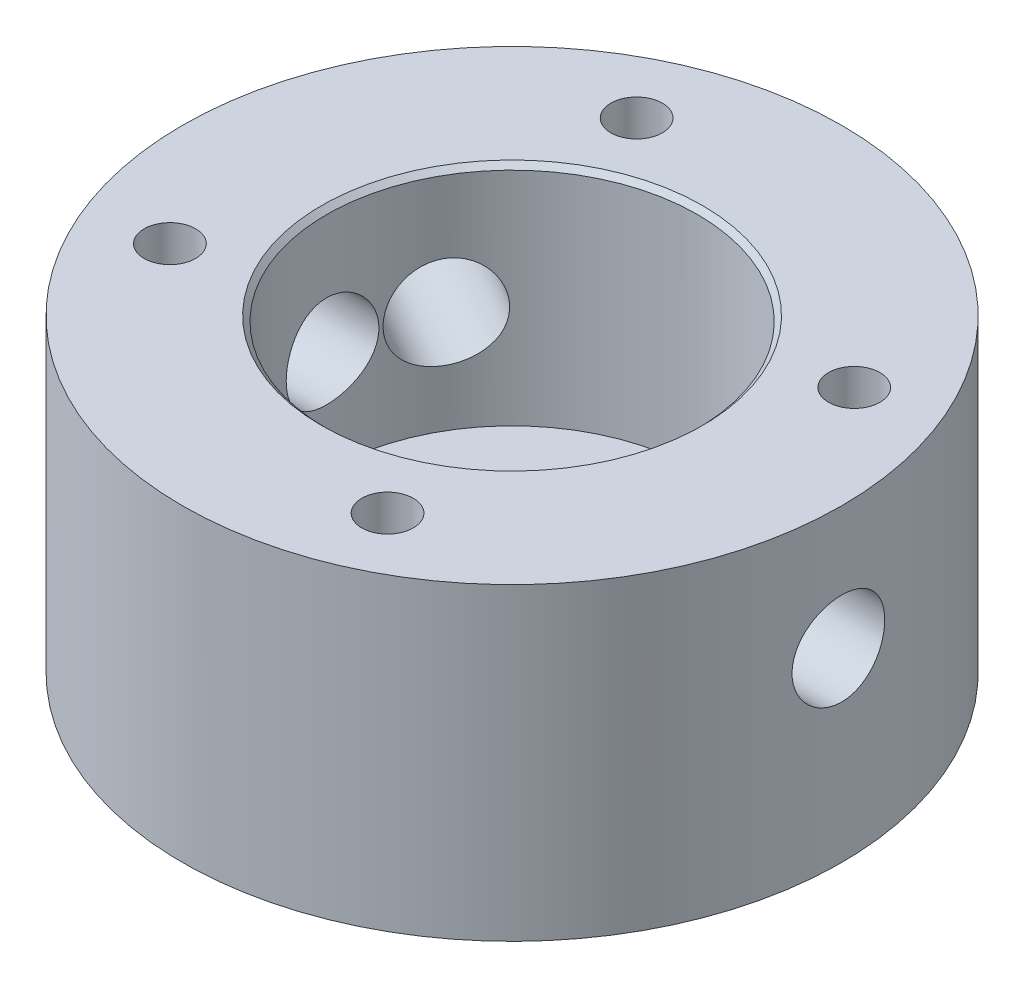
ISO-10303-21;
HEADER;
FILE_DESCRIPTION(('STEP AP214'),'2;1');
FILE_NAME('part.step','',(''),(''),'','','');
FILE_SCHEMA(('AUTOMOTIVE_DESIGN { 1 0 10303 214 1 1 1 1 }'));
ENDSEC;
DATA;
#1=APPLICATION_CONTEXT('core data for automotive mechanical design processes');
#2=APPLICATION_PROTOCOL_DEFINITION('international standard','automotive_design',2000,#1);
#3=PRODUCT_CONTEXT('',#1,'mechanical');
#4=PRODUCT('Part','Part','',(#3));
#5=PRODUCT_RELATED_PRODUCT_CATEGORY('part','',(#4));
#6=PRODUCT_DEFINITION_FORMATION('','',#4);
#7=PRODUCT_DEFINITION_CONTEXT('part definition',#1,'design');
#8=PRODUCT_DEFINITION('design','',#6,#7);
#9=PRODUCT_DEFINITION_SHAPE('','',#8);
#10=(LENGTH_UNIT() NAMED_UNIT(*) SI_UNIT(.MILLI.,.METRE.));
#11=(NAMED_UNIT(*) PLANE_ANGLE_UNIT() SI_UNIT($,.RADIAN.));
#12=(NAMED_UNIT(*) SI_UNIT($,.STERADIAN.) SOLID_ANGLE_UNIT());
#13=UNCERTAINTY_MEASURE_WITH_UNIT(LENGTH_MEASURE(1.E-05),#10,'distance_accuracy_value','');
#14=(GEOMETRIC_REPRESENTATION_CONTEXT(3) GLOBAL_UNCERTAINTY_ASSIGNED_CONTEXT((#13)) GLOBAL_UNIT_ASSIGNED_CONTEXT((#10,
#11,#12)) REPRESENTATION_CONTEXT('',''));
#15=CARTESIAN_POINT('',(0.,0.,0.));
#16=DIRECTION('',(0.,0.,1.));
#17=DIRECTION('',(1.,0.,0.));
#18=AXIS2_PLACEMENT_3D('',#15,#16,#17);
#19=CARTESIAN_POINT('',(0.,-9.,0.));
#20=DIRECTION('',(0.,-1.,0.));
#21=DIRECTION('',(0.,0.,-1.));
#22=AXIS2_PLACEMENT_3D('',#19,#20,#21);
#23=CYLINDRICAL_SURFACE('',#22,9.);
#24=CARTESIAN_POINT('',(-8.71421252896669,0.,2.24999999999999));
#25=CARTESIAN_POINT('',(-8.71421490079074,-0.124245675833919,2.24999647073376));
#26=CARTESIAN_POINT('',(-8.71689875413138,-0.248530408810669,2.23967362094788));
#27=CARTESIAN_POINT('',(-8.72731675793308,-0.493530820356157,2.19872081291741));
#28=CARTESIAN_POINT('',(-8.73505384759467,-0.614244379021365,2.16807903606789));
#29=CARTESIAN_POINT('',(-8.75464852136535,-0.848523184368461,2.08754207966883));
#30=CARTESIAN_POINT('',(-8.76650078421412,-0.962097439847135,2.03767175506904));
#31=CARTESIAN_POINT('',(-8.79298372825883,-1.17927976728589,1.92016902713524));
#32=CARTESIAN_POINT('',(-8.8076145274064,-1.28288741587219,1.85253586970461));
#33=CARTESIAN_POINT('',(-8.83836644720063,-1.47947548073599,1.69983758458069));
#34=CARTESIAN_POINT('',(-8.85451137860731,-1.57220424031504,1.61445319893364));
#35=CARTESIAN_POINT('',(-8.88626587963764,-1.7421852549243,1.42936385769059));
#36=CARTESIAN_POINT('',(-8.9018753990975,-1.81943606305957,1.32965756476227));
#37=CARTESIAN_POINT('',(-8.93106373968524,-1.95729792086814,1.11703068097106));
#38=CARTESIAN_POINT('',(-8.94461118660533,-2.01766174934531,1.0039451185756));
#39=CARTESIAN_POINT('',(-8.96787730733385,-2.11842867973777,0.768836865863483));
#40=CARTESIAN_POINT('',(-8.9775965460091,-2.15883472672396,0.646815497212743));
#41=CARTESIAN_POINT('',(-8.99194282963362,-2.21773305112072,0.399922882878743));
#42=CARTESIAN_POINT('',(-8.99666904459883,-2.23665267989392,0.275159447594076));
#43=CARTESIAN_POINT('',(-9.00084234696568,-2.25338254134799,0.0241459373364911));
#44=CARTESIAN_POINT('',(-9.00029021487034,-2.25119589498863,-0.102103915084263));
#45=CARTESIAN_POINT('',(-8.9940428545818,-2.22608263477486,-0.349542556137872));
#46=CARTESIAN_POINT('',(-8.98846202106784,-2.20361730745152,-0.470781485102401));
#47=CARTESIAN_POINT('',(-8.97291752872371,-2.13932585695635,-0.707711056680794));
#48=CARTESIAN_POINT('',(-8.96295363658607,-2.09749870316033,-0.823401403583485));
#49=CARTESIAN_POINT('',(-8.93958758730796,-1.99529768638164,-1.04716508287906));
#50=CARTESIAN_POINT('',(-8.9261551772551,-1.93475965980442,-1.15516014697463));
#51=CARTESIAN_POINT('',(-8.89730913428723,-1.79697988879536,-1.3596201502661));
#52=CARTESIAN_POINT('',(-8.88189515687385,-1.71973523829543,-1.45608307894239));
#53=CARTESIAN_POINT('',(-8.85027342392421,-1.54826213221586,-1.63749157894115));
#54=CARTESIAN_POINT('',(-8.83405547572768,-1.45363059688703,-1.72205477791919));
#55=CARTESIAN_POINT('',(-8.80303539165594,-1.25136002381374,-1.87419684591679));
#56=CARTESIAN_POINT('',(-8.7882333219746,-1.143720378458,-1.94177492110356));
#57=CARTESIAN_POINT('',(-8.76168447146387,-0.917738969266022,-2.05827329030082));
#58=CARTESIAN_POINT('',(-8.74995285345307,-0.799347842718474,-2.10710152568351));
#59=CARTESIAN_POINT('',(-8.73106776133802,-0.555673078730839,-2.18404264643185));
#60=CARTESIAN_POINT('',(-8.72391330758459,-0.430390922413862,-2.21215996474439));
#61=CARTESIAN_POINT('',(-8.71519820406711,-0.180036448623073,-2.24624667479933));
#62=CARTESIAN_POINT('',(-8.7134948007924,-0.0550459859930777,-2.2527814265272));
#63=CARTESIAN_POINT('',(-8.71548609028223,0.194239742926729,-2.24506529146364));
#64=CARTESIAN_POINT('',(-8.71918028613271,0.318535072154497,-2.23081631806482));
#65=CARTESIAN_POINT('',(-8.73141373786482,0.560802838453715,-2.18243291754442));
#66=CARTESIAN_POINT('',(-8.73987273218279,0.678845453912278,-2.14862766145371));
#67=CARTESIAN_POINT('',(-8.76060646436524,0.907588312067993,-2.06245627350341));
#68=CARTESIAN_POINT('',(-8.77288165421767,1.0182876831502,-2.01008794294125));
#69=CARTESIAN_POINT('',(-8.8001652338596,1.2315971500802,-1.88709360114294));
#70=CARTESIAN_POINT('',(-8.81522251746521,1.33400595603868,-1.81612957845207));
#71=CARTESIAN_POINT('',(-8.84625374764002,1.52566952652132,-1.65838565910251));
#72=CARTESIAN_POINT('',(-8.86222784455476,1.61492212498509,-1.57160316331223));
#73=CARTESIAN_POINT('',(-8.89377662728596,1.78002993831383,-1.38209112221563));
#74=CARTESIAN_POINT('',(-8.90933131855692,1.85549405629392,-1.27901689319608));
#75=CARTESIAN_POINT('',(-8.93787494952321,1.98804228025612,-1.06133103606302));
#76=CARTESIAN_POINT('',(-8.95086402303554,2.04512734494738,-0.946720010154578));
#77=CARTESIAN_POINT('',(-8.97273104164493,2.13880143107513,-0.710005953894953));
#78=CARTESIAN_POINT('',(-8.98163847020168,2.17553785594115,-0.587964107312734));
#79=CARTESIAN_POINT('',(-8.9944676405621,2.22791430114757,-0.339186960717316));
#80=CARTESIAN_POINT('',(-8.99839034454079,2.24355839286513,-0.212452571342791));
#81=CARTESIAN_POINT('',(-9.00076881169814,2.25307707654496,0.0384379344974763));
#82=CARTESIAN_POINT('',(-8.99936952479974,2.24752884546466,0.162571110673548));
#83=CARTESIAN_POINT('',(-8.99158267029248,2.21614238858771,0.408076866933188));
#84=CARTESIAN_POINT('',(-8.9851952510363,2.19030476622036,0.529449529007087));
#85=CARTESIAN_POINT('',(-8.9681722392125,2.11938250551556,0.765384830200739));
#86=CARTESIAN_POINT('',(-8.95755970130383,2.07440223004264,0.879980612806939));
#87=CARTESIAN_POINT('',(-8.93320400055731,1.96656619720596,1.10006336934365));
#88=CARTESIAN_POINT('',(-8.91946044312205,1.9037081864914,1.20554919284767));
#89=CARTESIAN_POINT('',(-8.88991311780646,1.7601407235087,1.40715433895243));
#90=CARTESIAN_POINT('',(-8.87406788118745,1.67903967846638,1.50298872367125));
#91=CARTESIAN_POINT('',(-8.84228960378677,1.50204858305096,1.67988379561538));
#92=CARTESIAN_POINT('',(-8.8263565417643,1.40615478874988,1.76094073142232));
#93=CARTESIAN_POINT('',(-8.7958682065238,1.20014681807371,1.90746455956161));
#94=CARTESIAN_POINT('',(-8.781344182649,1.08980072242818,1.97261239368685));
#95=CARTESIAN_POINT('',(-8.75573899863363,0.859375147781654,2.0833355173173));
#96=CARTESIAN_POINT('',(-8.74465533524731,0.739302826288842,2.12892504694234));
#97=CARTESIAN_POINT('',(-8.72891794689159,0.516201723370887,2.19245068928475));
#98=CARTESIAN_POINT('',(-8.72344491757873,0.414240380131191,2.21398463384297));
#99=CARTESIAN_POINT('',(-8.71609136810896,0.208195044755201,2.24276015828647));
#100=CARTESIAN_POINT('',(-8.71421054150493,0.104111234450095,2.25000295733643));
#101=CARTESIAN_POINT('',(-8.71421252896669,0.,2.24999999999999));
#102=B_SPLINE_CURVE_WITH_KNOTS('',3,(#24,#25,#26,#27,#28,#29,#30,#31,#32,#33,#34,#35,#36,#37,
#38,#39,#40,#41,#42,#43,#44,#45,#46,#47,#48,#49,#50,#51,#52,#53,#54,#55,#56,#57,#58,#59,#60,#61,
#62,#63,#64,#65,#66,#67,#68,#69,#70,#71,#72,#73,#74,#75,#76,#77,#78,#79,#80,#81,#82,#83,#84,#85,
#86,#87,#88,#89,#90,#91,#92,#93,#94,#95,#96,#97,#98,#99,#100,#101),.UNSPECIFIED.,.T.,.F.,(4,2,2,
2,2,2,2,2,2,2,2,2,2,2,2,2,2,2,2,2,2,2,2,2,2,2,2,2,2,2,2,2,2,2,2,2,2,2,4),(0.,0.372354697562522,
0.744926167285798,1.11701765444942,1.4891249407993,1.86861558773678,2.24814169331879,
2.63296346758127,3.01772843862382,3.39469875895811,3.77161333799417,4.14016436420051,
4.50873501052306,4.88063586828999,5.25260146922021,5.63463419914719,6.0166847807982,
6.40058788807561,6.78440880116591,7.15809217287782,7.5317411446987,7.89927664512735,
8.26685569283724,8.6416456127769,9.01649717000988,9.40072797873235,9.78493874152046,
10.1663286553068,10.5476449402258,10.9186510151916,11.2896460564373,11.6586438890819,
12.0276882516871,12.4055738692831,12.7835552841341,13.1685882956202,13.5533404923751,
13.8653804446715,14.1773937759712),.UNSPECIFIED.);
#103=CARTESIAN_POINT('',(-8.71421252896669,0.,2.24999999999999));
#104=VERTEX_POINT('',#103);
#105=EDGE_CURVE('E79',#104,#104,#102,.T.);
#106=ORIENTED_EDGE('',*,*,#105,.F.);
#107=EDGE_LOOP('',(#106));
#108=FACE_BOUND('',#107,.T.);
#109=CARTESIAN_POINT('',(0.,5.74999999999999,0.));
#110=DIRECTION('',(0.,1.,0.));
#111=DIRECTION('',(0.,0.,1.));
#112=AXIS2_PLACEMENT_3D('',#109,#110,#111);
#113=CIRCLE('',#112,9.);
#114=CARTESIAN_POINT('',(0.,5.74999999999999,9.));
#115=VERTEX_POINT('',#114);
#116=EDGE_CURVE('E176',#115,#115,#113,.T.);
#117=ORIENTED_EDGE('',*,*,#116,.T.);
#118=EDGE_LOOP('',(#117));
#119=FACE_BOUND('',#118,.T.);
#120=CARTESIAN_POINT('',(-8.67172942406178,0.,-2.4085491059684));
#121=CARTESIAN_POINT('',(-8.67172971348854,-0.124245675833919,-2.40855334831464));
#122=CARTESIAN_POINT('',(-8.66889257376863,-0.248530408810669,-2.41883512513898));
#123=CARTESIAN_POINT('',(-8.65743842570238,-0.493530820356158,-2.45951029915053));
#124=CARTESIAN_POINT('',(-8.64881805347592,-0.614244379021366,-2.4899154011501));
#125=CARTESIAN_POINT('',(-8.62551906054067,-0.848523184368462,-2.56945978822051));
#126=CARTESIAN_POINT('',(-8.61084825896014,-0.962097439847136,-2.61857488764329));
#127=CARTESIAN_POINT('',(-8.57503179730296,-1.17927976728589,-2.73357670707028));
#128=CARTESIAN_POINT('',(-8.55388586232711,-1.28288741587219,-2.79946413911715));
#129=CARTESIAN_POINT('',(-8.50416866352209,-1.47947548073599,-2.9470806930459));
#130=CARTESIAN_POINT('',(-8.47545839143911,-1.57220424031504,-3.02909820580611));
#131=CARTESIAN_POINT('',(-8.41041392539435,-1.7421852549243,-3.20526752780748));
#132=CARTESIAN_POINT('',(-8.37407901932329,-1.81943606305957,-3.29942047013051));
#133=CARTESIAN_POINT('',(-8.29304342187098,-1.95729792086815,-3.49815492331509));
#134=CARTESIAN_POINT('',(-8.24823307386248,-2.01766174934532,-3.60286361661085));
#135=CARTESIAN_POINT('',(-8.15082799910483,-2.11842867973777,-3.81810639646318));
#136=CARTESIAN_POINT('',(-8.09823442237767,-2.15883472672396,-3.92863962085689));
#137=CARTESIAN_POINT('',(-7.9872123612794,-2.21773305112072,-4.14962803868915));
#138=CARTESIAN_POINT('',(-7.92892366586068,-2.23665267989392,-4.26003945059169));
#139=CARTESIAN_POINT('',(-7.80703109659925,-2.253382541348,-4.47951017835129));
#140=CARTESIAN_POINT('',(-7.74342800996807,-2.25119589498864,-4.58856969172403));
#141=CARTESIAN_POINT('',(-7.61429831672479,-2.22608263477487,-4.79973416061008));
#142=CARTESIAN_POINT('',(-7.54884570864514,-2.20361730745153,-4.901939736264));
#143=CARTESIAN_POINT('',(-7.416918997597,-2.13932585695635,-5.09935451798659));
#144=CARTESIAN_POINT('',(-7.35044484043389,-2.09749870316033,-5.19456335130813));
#145=CARTESIAN_POINT('',(-7.21832740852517,-1.99529768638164,-5.37666535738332));
#146=CARTESIAN_POINT('',(-7.15269706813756,-1.93475965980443,-5.46347562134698));
#147=CARTESIAN_POINT('',(-7.02548566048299,-1.79697988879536,-5.6261201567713));
#148=CARTESIAN_POINT('',(-6.96390530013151,-1.71973523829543,-5.70195251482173));
#149=CARTESIAN_POINT('',(-6.84581582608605,-1.54826213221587,-5.84324601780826));
#150=CARTESIAN_POINT('',(-6.78948907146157,-1.45363059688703,-5.90837092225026));
#151=CARTESIAN_POINT('',(-6.68655385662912,-1.25136002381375,-6.02461977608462));
#152=CARTESIAN_POINT('',(-6.6399458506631,-1.143720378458,-6.07574307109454));
#153=CARTESIAN_POINT('',(-6.55870468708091,-0.917738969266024,-6.16335919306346));
#154=CARTESIAN_POINT('',(-6.52413069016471,-0.799347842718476,-6.19977987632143));
#155=CARTESIAN_POINT('',(-6.4693051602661,-0.555673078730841,-6.25697029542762));
#156=CARTESIAN_POINT('',(-6.44905056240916,-0.430390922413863,-6.27774338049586));
#157=CARTESIAN_POINT('',(-6.42445970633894,-0.180036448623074,-6.30290578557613));
#158=CARTESIAN_POINT('',(-6.41971713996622,-0.0550459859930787,-6.30771334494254));
#159=CARTESIAN_POINT('',(-6.42529971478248,0.194239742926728,-6.30202662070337));
#160=CARTESIAN_POINT('',(-6.43562346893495,0.318535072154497,-6.29153374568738));
#161=CARTESIAN_POINT('',(-6.47040964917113,0.560802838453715,-6.2557492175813));
#162=CARTESIAN_POINT('',(-6.49463798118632,0.678845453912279,-6.23070250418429));
#163=CARTESIAN_POINT('',(-6.55567961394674,0.907588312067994,-6.16644275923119));
#164=CARTESIAN_POINT('',(-6.5924944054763,1.01828768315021,-6.12722804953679));
#165=CARTESIAN_POINT('',(-6.67761984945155,1.2315971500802,-6.03435361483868));
#166=CARTESIAN_POINT('',(-6.72614185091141,1.33400595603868,-5.98042561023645));
#167=CARTESIAN_POINT('',(-6.83188764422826,1.52566952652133,-5.85933098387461));
#168=CARTESIAN_POINT('',(-6.88911286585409,1.61492212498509,-5.79216218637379));
#169=CARTESIAN_POINT('',(-7.01119093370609,1.78002993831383,-5.6438143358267));
#170=CARTESIAN_POINT('',(-7.07619880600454,1.85549405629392,-5.56232678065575));
#171=CARTESIAN_POINT('',(-7.20976124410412,1.98804228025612,-5.38807711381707));
#172=CARTESIAN_POINT('',(-7.27831562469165,2.04512734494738,-5.29531559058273));
#173=CARTESIAN_POINT('',(-7.41561004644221,2.13880143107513,-5.10124871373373));
#174=CARTESIAN_POINT('',(-7.48434502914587,2.17553785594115,-5.00001108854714));
#175=CARTESIAN_POINT('',(-7.61984398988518,2.22791430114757,-4.79097834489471));
#176=CARTESIAN_POINT('',(-7.68660834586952,2.24355839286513,-4.68318449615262));
#177=CARTESIAN_POINT('',(-7.81411341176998,2.25307707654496,-4.46709617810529));
#178=CARTESIAN_POINT('',(-7.87496818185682,2.24752884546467,-4.35889405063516));
#179=CARTESIAN_POINT('',(-7.99097744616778,2.21614238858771,-4.14238640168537));
#180=CARTESIAN_POINT('',(-8.04613210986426,2.19030476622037,-4.03408088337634));
#181=CARTESIAN_POINT('',(-8.14935739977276,2.11938250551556,-3.82124341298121));
#182=CARTESIAN_POINT('',(-8.19746456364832,2.07440223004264,-3.71669428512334));
#183=CARTESIAN_POINT('',(-8.28641328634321,1.96656619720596,-3.51391917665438));
#184=CARTESIAN_POINT('',(-8.32725392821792,1.90370818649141,-3.41569399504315));
#185=CARTESIAN_POINT('',(-8.40246776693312,1.7601407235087,-3.22632515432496));
#186=CARTESIAN_POINT('',(-8.4366625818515,1.67903967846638,-3.13540752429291));
#187=CARTESIAN_POINT('',(-8.49758932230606,1.50204858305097,-2.96632275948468));
#188=CARTESIAN_POINT('',(-8.524319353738,1.40615478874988,-2.88815886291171));
#189=CARTESIAN_POINT('',(-8.57117759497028,1.20014681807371,-2.74602133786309));
#190=CARTESIAN_POINT('',(-8.59117333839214,1.08980072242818,-2.6823396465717));
#191=CARTESIAN_POINT('',(-8.62436016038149,0.859375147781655,-2.57364801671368));
#192=CARTESIAN_POINT('',(-8.63755619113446,0.739302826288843,-2.52862449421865));
#193=CARTESIAN_POINT('',(-8.65569003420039,0.516201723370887,-2.46574097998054));
#194=CARTESIAN_POINT('',(-8.6617172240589,0.414240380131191,-2.444355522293));
#195=CARTESIAN_POINT('',(-8.66973662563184,0.208195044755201,-2.41575841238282));
#196=CARTESIAN_POINT('',(-8.67172918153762,0.104111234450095,-2.40854555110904));
#197=CARTESIAN_POINT('',(-8.67172942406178,0.,-2.4085491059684));
#198=B_SPLINE_CURVE_WITH_KNOTS('',3,(#120,#121,#122,#123,#124,#125,#126,#127,#128,#129,#130,
#131,#132,#133,#134,#135,#136,#137,#138,#139,#140,#141,#142,#143,#144,#145,#146,#147,#148,#149,
#150,#151,#152,#153,#154,#155,#156,#157,#158,#159,#160,#161,#162,#163,#164,#165,#166,#167,#168,
#169,#170,#171,#172,#173,#174,#175,#176,#177,#178,#179,#180,#181,#182,#183,#184,#185,#186,#187,
#188,#189,#190,#191,#192,#193,#194,#195,#196,#197),.UNSPECIFIED.,.T.,.F.,(4,2,2,2,2,2,2,2,2,2,2,
2,2,2,2,2,2,2,2,2,2,2,2,2,2,2,2,2,2,2,2,2,2,2,2,2,2,2,4),(0.,0.372354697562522,
0.744926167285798,1.11701765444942,1.4891249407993,1.86861558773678,2.2481416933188,
2.63296346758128,3.01772843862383,3.39469875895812,3.77161333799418,4.14016436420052,
4.50873501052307,4.88063586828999,5.25260146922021,5.6346341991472,6.01668478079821,
6.40058788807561,6.78440880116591,7.15809217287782,7.53174114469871,7.89927664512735,
8.26685569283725,8.64164561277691,9.01649717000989,9.40072797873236,9.78493874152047,
10.1663286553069,10.5476449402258,10.9186510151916,11.2896460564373,11.6586438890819,
12.0276882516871,12.4055738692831,12.7835552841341,13.1685882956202,13.5533404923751,
13.8653804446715,14.1773937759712),.UNSPECIFIED.);
#199=CARTESIAN_POINT('',(-8.67172942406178,0.,-2.4085491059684));
#200=VERTEX_POINT('',#199);
#201=EDGE_CURVE('E100',#200,#200,#198,.T.);
#202=ORIENTED_EDGE('',*,*,#201,.F.);
#203=EDGE_LOOP('',(#202));
#204=FACE_BOUND('',#203,.T.);
#205=CARTESIAN_POINT('',(8.71421252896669,0.,-2.25));
#206=CARTESIAN_POINT('',(8.71421490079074,-0.124245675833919,-2.24999647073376));
#207=CARTESIAN_POINT('',(8.71689875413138,-0.248530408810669,-2.23967362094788));
#208=CARTESIAN_POINT('',(8.72731675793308,-0.493530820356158,-2.19872081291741));
#209=CARTESIAN_POINT('',(8.73505384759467,-0.614244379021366,-2.16807903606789));
#210=CARTESIAN_POINT('',(8.75464852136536,-0.848523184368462,-2.08754207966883));
#211=CARTESIAN_POINT('',(8.76650078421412,-0.962097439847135,-2.03767175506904));
#212=CARTESIAN_POINT('',(8.79298372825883,-1.17927976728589,-1.92016902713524));
#213=CARTESIAN_POINT('',(8.8076145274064,-1.28288741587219,-1.85253586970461));
#214=CARTESIAN_POINT('',(8.83836644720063,-1.47947548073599,-1.69983758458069));
#215=CARTESIAN_POINT('',(8.85451137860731,-1.57220424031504,-1.61445319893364));
#216=CARTESIAN_POINT('',(8.88626587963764,-1.7421852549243,-1.42936385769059));
#217=CARTESIAN_POINT('',(8.9018753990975,-1.81943606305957,-1.32965756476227));
#218=CARTESIAN_POINT('',(8.93106373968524,-1.95729792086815,-1.11703068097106));
#219=CARTESIAN_POINT('',(8.94461118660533,-2.01766174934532,-1.00394511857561));
#220=CARTESIAN_POINT('',(8.96787730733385,-2.11842867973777,-0.768836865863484));
#221=CARTESIAN_POINT('',(8.9775965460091,-2.15883472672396,-0.646815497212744));
#222=CARTESIAN_POINT('',(8.99194282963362,-2.21773305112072,-0.399922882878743));
#223=CARTESIAN_POINT('',(8.99666904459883,-2.23665267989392,-0.275159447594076));
#224=CARTESIAN_POINT('',(9.00084234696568,-2.25338254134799,-0.0241459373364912));
#225=CARTESIAN_POINT('',(9.00029021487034,-2.25119589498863,0.102103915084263));
#226=CARTESIAN_POINT('',(8.9940428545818,-2.22608263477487,0.349542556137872));
#227=CARTESIAN_POINT('',(8.98846202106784,-2.20361730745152,0.470781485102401));
#228=CARTESIAN_POINT('',(8.97291752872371,-2.13932585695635,0.707711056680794));
#229=CARTESIAN_POINT('',(8.96295363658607,-2.09749870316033,0.823401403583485));
#230=CARTESIAN_POINT('',(8.93958758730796,-1.99529768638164,1.04716508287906));
#231=CARTESIAN_POINT('',(8.9261551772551,-1.93475965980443,1.15516014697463));
#232=CARTESIAN_POINT('',(8.89730913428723,-1.79697988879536,1.3596201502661));
#233=CARTESIAN_POINT('',(8.88189515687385,-1.71973523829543,1.45608307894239));
#234=CARTESIAN_POINT('',(8.85027342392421,-1.54826213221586,1.63749157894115));
#235=CARTESIAN_POINT('',(8.83405547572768,-1.45363059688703,1.72205477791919));
#236=CARTESIAN_POINT('',(8.80303539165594,-1.25136002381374,1.8741968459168));
#237=CARTESIAN_POINT('',(8.7882333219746,-1.143720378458,1.94177492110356));
#238=CARTESIAN_POINT('',(8.76168447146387,-0.917738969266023,2.05827329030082));
#239=CARTESIAN_POINT('',(8.74995285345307,-0.799347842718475,2.10710152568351));
#240=CARTESIAN_POINT('',(8.73106776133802,-0.55567307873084,2.18404264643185));
#241=CARTESIAN_POINT('',(8.72391330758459,-0.430390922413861,2.21215996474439));
#242=CARTESIAN_POINT('',(8.71519820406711,-0.180036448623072,2.24624667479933));
#243=CARTESIAN_POINT('',(8.7134948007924,-0.0550459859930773,2.2527814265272));
#244=CARTESIAN_POINT('',(8.71548609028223,0.194239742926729,2.24506529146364));
#245=CARTESIAN_POINT('',(8.71918028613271,0.318535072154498,2.23081631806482));
#246=CARTESIAN_POINT('',(8.73141373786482,0.560802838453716,2.18243291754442));
#247=CARTESIAN_POINT('',(8.73987273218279,0.678845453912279,2.14862766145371));
#248=CARTESIAN_POINT('',(8.76060646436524,0.907588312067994,2.06245627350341));
#249=CARTESIAN_POINT('',(8.77288165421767,1.0182876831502,2.01008794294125));
#250=CARTESIAN_POINT('',(8.8001652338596,1.2315971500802,1.88709360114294));
#251=CARTESIAN_POINT('',(8.81522251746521,1.33400595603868,1.81612957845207));
#252=CARTESIAN_POINT('',(8.84625374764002,1.52566952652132,1.65838565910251));
#253=CARTESIAN_POINT('',(8.86222784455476,1.61492212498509,1.57160316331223));
#254=CARTESIAN_POINT('',(8.89377662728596,1.78002993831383,1.38209112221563));
#255=CARTESIAN_POINT('',(8.90933131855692,1.85549405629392,1.27901689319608));
#256=CARTESIAN_POINT('',(8.93787494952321,1.98804228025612,1.06133103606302));
#257=CARTESIAN_POINT('',(8.95086402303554,2.04512734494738,0.946720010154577));
#258=CARTESIAN_POINT('',(8.97273104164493,2.13880143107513,0.710005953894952));
#259=CARTESIAN_POINT('',(8.98163847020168,2.17553785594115,0.587964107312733));
#260=CARTESIAN_POINT('',(8.9944676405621,2.22791430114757,0.339186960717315));
#261=CARTESIAN_POINT('',(8.99839034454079,2.24355839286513,0.21245257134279));
#262=CARTESIAN_POINT('',(9.00076881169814,2.25307707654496,-0.0384379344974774));
#263=CARTESIAN_POINT('',(8.99936952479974,2.24752884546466,-0.162571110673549));
#264=CARTESIAN_POINT('',(8.99158267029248,2.21614238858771,-0.408076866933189));
#265=CARTESIAN_POINT('',(8.9851952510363,2.19030476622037,-0.529449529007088));
#266=CARTESIAN_POINT('',(8.9681722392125,2.11938250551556,-0.76538483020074));
#267=CARTESIAN_POINT('',(8.95755970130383,2.07440223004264,-0.87998061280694));
#268=CARTESIAN_POINT('',(8.9332040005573,1.96656619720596,-1.10006336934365));
#269=CARTESIAN_POINT('',(8.91946044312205,1.90370818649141,-1.20554919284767));
#270=CARTESIAN_POINT('',(8.88991311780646,1.7601407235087,-1.40715433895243));
#271=CARTESIAN_POINT('',(8.87406788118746,1.67903967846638,-1.50298872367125));
#272=CARTESIAN_POINT('',(8.84228960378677,1.50204858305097,-1.67988379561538));
#273=CARTESIAN_POINT('',(8.8263565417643,1.40615478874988,-1.76094073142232));
#274=CARTESIAN_POINT('',(8.7958682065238,1.20014681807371,-1.90746455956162));
#275=CARTESIAN_POINT('',(8.781344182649,1.08980072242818,-1.97261239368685));
#276=CARTESIAN_POINT('',(8.75573899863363,0.859375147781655,-2.0833355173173));
#277=CARTESIAN_POINT('',(8.74465533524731,0.739302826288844,-2.12892504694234));
#278=CARTESIAN_POINT('',(8.72891794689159,0.516201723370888,-2.19245068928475));
#279=CARTESIAN_POINT('',(8.72344491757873,0.414240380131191,-2.21398463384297));
#280=CARTESIAN_POINT('',(8.71609136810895,0.208195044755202,-2.24276015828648));
#281=CARTESIAN_POINT('',(8.71421054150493,0.104111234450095,-2.25000295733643));
#282=CARTESIAN_POINT('',(8.71421252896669,0.,-2.25));
#283=B_SPLINE_CURVE_WITH_KNOTS('',3,(#205,#206,#207,#208,#209,#210,#211,#212,#213,#214,#215,
#216,#217,#218,#219,#220,#221,#222,#223,#224,#225,#226,#227,#228,#229,#230,#231,#232,#233,#234,
#235,#236,#237,#238,#239,#240,#241,#242,#243,#244,#245,#246,#247,#248,#249,#250,#251,#252,#253,
#254,#255,#256,#257,#258,#259,#260,#261,#262,#263,#264,#265,#266,#267,#268,#269,#270,#271,#272,
#273,#274,#275,#276,#277,#278,#279,#280,#281,#282),.UNSPECIFIED.,.T.,.F.,(4,2,2,2,2,2,2,2,2,2,2,
2,2,2,2,2,2,2,2,2,2,2,2,2,2,2,2,2,2,2,2,2,2,2,2,2,2,2,4),(0.,0.372354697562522,
0.744926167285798,1.11701765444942,1.4891249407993,1.86861558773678,2.24814169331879,
2.63296346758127,3.01772843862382,3.39469875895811,3.77161333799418,4.14016436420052,
4.50873501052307,4.88063586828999,5.25260146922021,5.63463419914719,6.01668478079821,
6.40058788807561,6.78440880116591,7.15809217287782,7.53174114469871,7.89927664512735,
8.26685569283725,8.6416456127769,9.01649717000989,9.40072797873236,9.78493874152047,
10.1663286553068,10.5476449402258,10.9186510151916,11.2896460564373,11.6586438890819,
12.0276882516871,12.4055738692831,12.7835552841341,13.1685882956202,13.5533404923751,
13.8653804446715,14.1773937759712),.UNSPECIFIED.);
#284=CARTESIAN_POINT('',(8.71421252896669,0.,-2.25));
#285=VERTEX_POINT('',#284);
#286=EDGE_CURVE('E107',#285,#285,#283,.T.);
#287=ORIENTED_EDGE('',*,*,#286,.F.);
#288=EDGE_LOOP('',(#287));
#289=FACE_BOUND('',#288,.T.);
#290=CARTESIAN_POINT('',(0.,-5.,0.));
#291=DIRECTION('',(0.,-1.,0.));
#292=DIRECTION('',(0.,0.,-1.));
#293=AXIS2_PLACEMENT_3D('',#290,#291,#292);
#294=CIRCLE('',#293,9.);
#295=CARTESIAN_POINT('',(0.,-5.,-9.));
#296=VERTEX_POINT('',#295);
#297=EDGE_CURVE('E133',#296,#296,#294,.T.);
#298=ORIENTED_EDGE('',*,*,#297,.T.);
#299=EDGE_LOOP('',(#298));
#300=FACE_BOUND('',#299,.T.);
#301=ADVANCED_FACE('F37',(#108,#119,#204,#289,#300),#23,.F.);
#302=CARTESIAN_POINT('',(9.,-5.,0.));
#303=DIRECTION('',(0.,1.,0.));
#304=DIRECTION('',(0.,0.,1.));
#305=AXIS2_PLACEMENT_3D('',#302,#303,#304);
#306=PLANE('',#305);
#307=CARTESIAN_POINT('',(0.,-5.,0.));
#308=DIRECTION('',(0.,1.,0.));
#309=DIRECTION('',(0.,0.,1.));
#310=AXIS2_PLACEMENT_3D('',#307,#308,#309);
#311=CIRCLE('',#310,3.50000000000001);
#312=CARTESIAN_POINT('',(0.,-5.,3.50000000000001));
#313=VERTEX_POINT('',#312);
#314=EDGE_CURVE('E132',#313,#313,#311,.F.);
#315=ORIENTED_EDGE('',*,*,#314,.T.);
#316=EDGE_LOOP('',(#315));
#317=FACE_BOUND('',#316,.T.);
#318=ORIENTED_EDGE('',*,*,#297,.F.);
#319=EDGE_LOOP('',(#318));
#320=FACE_BOUND('',#319,.T.);
#321=ADVANCED_FACE('F161',(#317,#320),#306,.T.);
#322=CARTESIAN_POINT('',(0.,-9.,0.));
#323=DIRECTION('',(0.,-1.,0.));
#324=DIRECTION('',(0.,0.,-1.));
#325=AXIS2_PLACEMENT_3D('',#322,#323,#324);
#326=CYLINDRICAL_SURFACE('',#325,3.);
#327=CARTESIAN_POINT('',(0.,-5.50000000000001,0.));
#328=DIRECTION('',(0.,1.,0.));
#329=DIRECTION('',(0.,0.,1.));
#330=AXIS2_PLACEMENT_3D('',#327,#328,#329);
#331=CIRCLE('',#330,3.);
#332=CARTESIAN_POINT('',(0.,-5.50000000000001,3.));
#333=VERTEX_POINT('',#332);
#334=EDGE_CURVE('E174',#333,#333,#331,.T.);
#335=ORIENTED_EDGE('',*,*,#334,.T.);
#336=EDGE_LOOP('',(#335));
#337=FACE_BOUND('',#336,.T.);
#338=CARTESIAN_POINT('',(0.,-9.,0.));
#339=DIRECTION('',(0.,-1.,0.));
#340=DIRECTION('',(0.,0.,-1.));
#341=AXIS2_PLACEMENT_3D('',#338,#339,#340);
#342=CIRCLE('',#341,3.);
#343=CARTESIAN_POINT('',(0.,-9.,-3.));
#344=VERTEX_POINT('',#343);
#345=EDGE_CURVE('E153',#344,#344,#342,.T.);
#346=ORIENTED_EDGE('',*,*,#345,.T.);
#347=EDGE_LOOP('',(#346));
#348=FACE_BOUND('',#347,.T.);
#349=ADVANCED_FACE('F163',(#337,#348),#326,.F.);
#350=CARTESIAN_POINT('',(3.,-9.,0.));
#351=DIRECTION('',(0.,-1.,0.));
#352=DIRECTION('',(0.,0.,-1.));
#353=AXIS2_PLACEMENT_3D('',#350,#351,#352);
#354=PLANE('',#353);
#355=CARTESIAN_POINT('',(0.,-9.00000000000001,0.));
#356=DIRECTION('',(0.,-1.,0.));
#357=DIRECTION('',(0.,0.,-1.));
#358=AXIS2_PLACEMENT_3D('',#355,#356,#357);
#359=CIRCLE('',#358,16.);
#360=CARTESIAN_POINT('',(0.,-9.00000000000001,-16.));
#361=VERTEX_POINT('',#360);
#362=EDGE_CURVE('E151',#361,#361,#359,.T.);
#363=ORIENTED_EDGE('',*,*,#362,.T.);
#364=EDGE_LOOP('',(#363));
#365=FACE_BOUND('',#364,.T.);
#366=ORIENTED_EDGE('',*,*,#345,.F.);
#367=EDGE_LOOP('',(#366));
#368=FACE_BOUND('',#367,.T.);
#369=ADVANCED_FACE('F140',(#365,#368),#354,.T.);
#370=CARTESIAN_POINT('',(0.,-9.,0.));
#371=DIRECTION('',(0.,-1.,0.));
#372=DIRECTION('',(0.,0.,-1.));
#373=AXIS2_PLACEMENT_3D('',#370,#371,#372);
#374=CYLINDRICAL_SURFACE('',#373,16.);
#375=CARTESIAN_POINT('',(-15.8410069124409,0.,2.24999999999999));
#376=CARTESIAN_POINT('',(-15.8410089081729,0.125711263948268,2.24999474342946));
#377=CARTESIAN_POINT('',(-15.8425195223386,0.251497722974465,2.2394288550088));
#378=CARTESIAN_POINT('',(-15.8483953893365,0.49956021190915,2.19745203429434));
#379=CARTESIAN_POINT('',(-15.8527635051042,0.621832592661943,2.16602019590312));
#380=CARTESIAN_POINT('',(-15.8638500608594,0.859240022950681,2.08326491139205));
#381=CARTESIAN_POINT('',(-15.8705667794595,0.974380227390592,2.03195603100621));
#382=CARTESIAN_POINT('',(-15.885591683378,1.19439830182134,1.91093626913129));
#383=CARTESIAN_POINT('',(-15.893899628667,1.29927771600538,1.84122816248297));
#384=CARTESIAN_POINT('',(-15.9112364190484,1.49655482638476,1.68486330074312));
#385=CARTESIAN_POINT('',(-15.9202694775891,1.58886969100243,1.5981024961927));
#386=CARTESIAN_POINT('',(-15.9380009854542,1.7576803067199,1.41031953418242));
#387=CARTESIAN_POINT('',(-15.9466994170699,1.83417522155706,1.30929662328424));
#388=CARTESIAN_POINT('',(-15.9628253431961,1.96947705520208,1.0953300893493));
#389=CARTESIAN_POINT('',(-15.9702473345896,2.0282081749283,0.982338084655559));
#390=CARTESIAN_POINT('',(-15.9829375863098,2.12582920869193,0.747972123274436));
#391=CARTESIAN_POINT('',(-15.988205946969,2.16472004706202,0.626598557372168));
#392=CARTESIAN_POINT('',(-15.995965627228,2.22130676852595,0.379765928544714));
#393=CARTESIAN_POINT('',(-15.9984750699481,2.23914102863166,0.25433916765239));
#394=CARTESIAN_POINT('',(-16.0004961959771,2.25353769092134,0.00224984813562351));
#395=CARTESIAN_POINT('',(-16.0000080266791,2.25010113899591,-0.124412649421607));
#396=CARTESIAN_POINT('',(-15.9961034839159,2.22216359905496,-0.374434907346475));
#397=CARTESIAN_POINT('',(-15.9927078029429,2.1978114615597,-0.497811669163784));
#398=CARTESIAN_POINT('',(-15.9833928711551,2.12896728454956,-0.738709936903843));
#399=CARTESIAN_POINT('',(-15.9774735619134,2.0844747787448,-0.85623130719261));
#400=CARTESIAN_POINT('',(-15.963740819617,1.97645813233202,-1.08253739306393));
#401=CARTESIAN_POINT('',(-15.9559210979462,1.91287063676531,-1.19129147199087));
#402=CARTESIAN_POINT('',(-15.9392603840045,1.76851521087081,-1.39664172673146));
#403=CARTESIAN_POINT('',(-15.9304193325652,1.68774628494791,-1.49323719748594));
#404=CARTESIAN_POINT('',(-15.9126130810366,1.51048972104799,-1.67240453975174));
#405=CARTESIAN_POINT('',(-15.9036474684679,1.41387221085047,-1.75484793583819));
#406=CARTESIAN_POINT('',(-15.8866774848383,1.20810426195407,-1.90236950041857));
#407=CARTESIAN_POINT('',(-15.8786731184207,1.09895376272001,-1.96744758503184));
#408=CARTESIAN_POINT('',(-15.8645321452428,0.871092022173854,-2.07840456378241));
#409=CARTESIAN_POINT('',(-15.8583967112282,0.752374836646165,-2.12427140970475));
#410=CARTESIAN_POINT('',(-15.8487098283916,0.50881709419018,-2.19538076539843));
#411=CARTESIAN_POINT('',(-15.8451582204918,0.383976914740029,-2.220624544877));
#412=CARTESIAN_POINT('',(-15.8410708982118,0.132856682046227,-2.24959739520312));
#413=CARTESIAN_POINT('',(-15.8405097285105,0.00659798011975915,-2.25350806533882));
#414=CARTESIAN_POINT('',(-15.8423993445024,-0.244772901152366,-2.24018448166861));
#415=CARTESIAN_POINT('',(-15.8448500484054,-0.369885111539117,-2.22295080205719));
#416=CARTESIAN_POINT('',(-15.852463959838,-0.614856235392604,-2.16798130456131));
#417=CARTESIAN_POINT('',(-15.8576153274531,-0.734735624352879,-2.13033495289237));
#418=CARTESIAN_POINT('',(-15.870040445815,-0.966481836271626,-2.03570143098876));
#419=CARTESIAN_POINT('',(-15.8773142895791,-1.07834830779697,-1.97871341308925));
#420=CARTESIAN_POINT('',(-15.893225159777,-1.29171026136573,-1.84657390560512));
#421=CARTESIAN_POINT('',(-15.9018709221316,-1.39313190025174,-1.77130425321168));
#422=CARTESIAN_POINT('',(-15.9195247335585,-1.58196834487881,-1.60490346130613));
#423=CARTESIAN_POINT('',(-15.9285328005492,-1.66938245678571,-1.51377153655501));
#424=CARTESIAN_POINT('',(-15.9459752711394,-1.82836901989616,-1.31743587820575));
#425=CARTESIAN_POINT('',(-15.9544050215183,-1.89982152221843,-1.21213454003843));
#426=CARTESIAN_POINT('',(-15.9696698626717,-2.02402317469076,-0.990918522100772));
#427=CARTESIAN_POINT('',(-15.9765049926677,-2.07677278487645,-0.875004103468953));
#428=CARTESIAN_POINT('',(-15.98778997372,-2.16187707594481,-0.636236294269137));
#429=CARTESIAN_POINT('',(-15.992247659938,-2.19429881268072,-0.513407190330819));
#430=CARTESIAN_POINT('',(-15.9983082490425,-2.23804451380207,-0.263981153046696));
#431=CARTESIAN_POINT('',(-15.999911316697,-2.24936969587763,-0.137384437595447));
#432=CARTESIAN_POINT('',(-16.0000807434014,-2.25057384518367,0.114816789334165));
#433=CARTESIAN_POINT('',(-15.9986731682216,-2.24063689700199,0.240420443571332));
#434=CARTESIAN_POINT('',(-15.9930317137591,-2.19999157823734,0.488152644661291));
#435=CARTESIAN_POINT('',(-15.9887978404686,-2.16928325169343,0.61028119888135));
#436=CARTESIAN_POINT('',(-15.9779772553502,-2.08802928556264,0.847556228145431));
#437=CARTESIAN_POINT('',(-15.9713918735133,-2.03749485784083,0.962706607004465));
#438=CARTESIAN_POINT('',(-15.9565939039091,-1.91804250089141,1.18292248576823));
#439=CARTESIAN_POINT('',(-15.9483812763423,-1.84912412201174,1.28798773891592));
#440=CARTESIAN_POINT('',(-15.931158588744,-1.69418819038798,1.48598755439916));
#441=CARTESIAN_POINT('',(-15.9221425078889,-1.6080342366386,1.57881486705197));
#442=CARTESIAN_POINT('',(-15.9043751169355,-1.42135912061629,1.74876321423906));
#443=CARTESIAN_POINT('',(-15.8956238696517,-1.32083458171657,1.82588054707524));
#444=CARTESIAN_POINT('',(-15.8793311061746,-1.10769663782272,1.9625540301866));
#445=CARTESIAN_POINT('',(-15.8717957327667,-0.995026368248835,2.02202220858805));
#446=CARTESIAN_POINT('',(-15.8588598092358,-0.761248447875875,2.12110448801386));
#447=CARTESIAN_POINT('',(-15.8534570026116,-0.640149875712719,2.16073958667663));
#448=CARTESIAN_POINT('',(-15.8466715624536,-0.432061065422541,2.20983855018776));
#449=CARTESIAN_POINT('',(-15.8445583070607,-0.346367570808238,2.22487660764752));
#450=CARTESIAN_POINT('',(-15.8417252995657,-0.173794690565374,2.24495909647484));
#451=CARTESIAN_POINT('',(-15.8410055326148,-0.0869153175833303,2.25000363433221));
#452=CARTESIAN_POINT('',(-15.8410069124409,0.,2.24999999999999));
#453=B_SPLINE_CURVE_WITH_KNOTS('',3,(#375,#376,#377,#378,#379,#380,#381,#382,#383,#384,#385,
#386,#387,#388,#389,#390,#391,#392,#393,#394,#395,#396,#397,#398,#399,#400,#401,#402,#403,#404,
#405,#406,#407,#408,#409,#410,#411,#412,#413,#414,#415,#416,#417,#418,#419,#420,#421,#422,#423,
#424,#425,#426,#427,#428,#429,#430,#431,#432,#433,#434,#435,#436,#437,#438,#439,#440,#441,#442,
#443,#444,#445,#446,#447,#448,#449,#450,#451,#452),.UNSPECIFIED.,.T.,.F.,(4,2,2,2,2,2,2,2,2,2,2,
2,2,2,2,2,2,2,2,2,2,2,2,2,2,2,2,2,2,2,2,2,2,2,2,2,2,2,4),(0.,0.376816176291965,
0.754010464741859,1.13092886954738,1.50779046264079,1.88702721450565,2.26628400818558,
2.64713699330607,3.02797223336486,3.40629056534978,3.78459029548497,4.16021986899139,
4.53585813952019,4.9127567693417,5.28967724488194,5.66985673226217,6.05003805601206,
6.43045745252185,6.81085342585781,7.1880061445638,7.56514862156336,7.94065133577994,
8.31617050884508,8.69418463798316,9.07221748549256,9.45300216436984,9.83377747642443,
10.2132900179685,10.592780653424,10.9689990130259,11.3452165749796,11.7212216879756,
12.0972359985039,12.4763529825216,12.8555591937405,13.2366249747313,13.6172864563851,
13.8778155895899,14.138341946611),.UNSPECIFIED.);
#454=CARTESIAN_POINT('',(-15.8410069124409,0.,2.24999999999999));
#455=VERTEX_POINT('',#454);
#456=EDGE_CURVE('E11',#455,#455,#453,.T.);
#457=ORIENTED_EDGE('',*,*,#456,.F.);
#458=EDGE_LOOP('',(#457));
#459=FACE_BOUND('',#458,.T.);
#460=CARTESIAN_POINT('',(-14.8437144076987,0.,-5.97194629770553));
#461=CARTESIAN_POINT('',(-14.843713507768,0.125711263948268,-5.97195184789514));
#462=CARTESIAN_POINT('',(-14.8397387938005,0.251497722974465,-5.98185748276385));
#463=CARTESIAN_POINT('',(-14.8238390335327,0.49956021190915,-6.02114840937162));
#464=CARTESIAN_POINT('',(-14.8119060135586,0.621832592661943,-6.05055323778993));
#465=CARTESIAN_POINT('',(-14.7801296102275,0.859240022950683,-6.12776469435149));
#466=CARTESIAN_POINT('',(-14.7602920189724,0.974380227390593,-6.17555784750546));
#467=CARTESIAN_POINT('',(-14.7127940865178,1.19439830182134,-6.28787648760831));
#468=CARTESIAN_POINT('',(-14.6851349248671,1.29927771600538,-6.35239945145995));
#469=CARTESIAN_POINT('',(-14.6219665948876,1.49655482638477,-6.49648378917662));
#470=CARTESIAN_POINT('',(-14.5864090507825,1.58886969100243,-6.57613737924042));
#471=CARTESIAN_POINT('',(-14.5078735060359,1.7576803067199,-6.74762794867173));
#472=CARTESIAN_POINT('',(-14.4648951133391,1.83417522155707,-6.83946557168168));
#473=CARTESIAN_POINT('',(-14.3718773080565,1.96947705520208,-7.03282898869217));
#474=CARTESIAN_POINT('',(-14.321808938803,2.0282081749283,-7.1343939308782));
#475=CARTESIAN_POINT('',(-14.2156160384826,2.12582920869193,-7.3437059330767));
#476=CARTESIAN_POINT('',(-14.1594917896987,2.16472004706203,-7.45145270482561));
#477=CARTESIAN_POINT('',(-14.0427955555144,2.22130676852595,-7.66909587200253));
#478=CARTESIAN_POINT('',(-13.9822554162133,2.23914102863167,-7.77897335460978));
#479=CARTESIAN_POINT('',(-13.8579611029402,2.25353769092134,-7.9982996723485));
#480=CARTESIAN_POINT('',(-13.7942070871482,2.25010113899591,-8.10774852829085));
#481=CARTESIAN_POINT('',(-13.6658145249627,2.22216359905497,-8.32232188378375));
#482=CARTESIAN_POINT('',(-13.6011853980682,2.1978114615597,-8.42747145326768));
#483=CARTESIAN_POINT('',(-13.4726692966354,2.12896728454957,-8.63143800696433));
#484=CARTESIAN_POINT('',(-13.4087823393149,2.0844747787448,-8.73025484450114));
#485=CARTESIAN_POINT('',(-13.283736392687,1.97645813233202,-8.91937529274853));
#486=CARTESIAN_POINT('',(-13.222587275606,1.91287063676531,-9.00964922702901));
#487=CARTESIAN_POINT('',(-13.105483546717,1.76851521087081,-9.1791574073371));
#488=CARTESIAN_POINT('',(-13.0495292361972,1.68774628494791,-9.25839101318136));
#489=CARTESIAN_POINT('',(-12.9445248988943,1.51048972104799,-9.40465135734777));
#490=CARTESIAN_POINT('',(-12.8955387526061,1.41387221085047,-9.47156662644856));
#491=CARTESIAN_POINT('',(-12.8070815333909,1.20810426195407,-9.59083905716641));
#492=CARTESIAN_POINT('',(-12.7676105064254,1.09895376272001,-9.64319614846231));
#493=CARTESIAN_POINT('',(-12.6998855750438,0.871092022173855,-9.73221722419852));
#494=CARTESIAN_POINT('',(-12.6716387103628,0.752374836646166,-9.76887136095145));
#495=CARTESIAN_POINT('',(-12.627694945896,0.50881709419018,-9.82561042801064));
#496=CARTESIAN_POINT('',(-12.6119972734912,0.383976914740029,-9.84569637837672));
#497=CARTESIAN_POINT('',(-12.5939711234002,0.132856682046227,-9.86874394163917));
#498=CARTESIAN_POINT('',(-12.5915298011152,0.00659798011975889,-9.87185009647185));
#499=CARTESIAN_POINT('',(-12.5998280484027,-0.244772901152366,-9.86125634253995));
#500=CARTESIAN_POINT('',(-12.6105672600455,-0.369885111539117,-9.84755689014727));
#501=CARTESIAN_POINT('',(-12.6446458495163,-0.614856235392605,-9.80375886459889));
#502=CARTESIAN_POINT('',(-12.6679302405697,-0.73473562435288,-9.77373185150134));
#503=CARTESIAN_POINT('',(-12.7260074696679,-0.966481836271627,-9.69798937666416));
#504=CARTESIAN_POINT('',(-12.7608008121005,-1.07834830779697,-9.65227322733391));
#505=CARTESIAN_POINT('',(-12.8406497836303,-1.29171026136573,-9.54579249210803));
#506=CARTESIAN_POINT('',(-12.8857720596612,-1.39313190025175,-9.48492994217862));
#507=CARTESIAN_POINT('',(-12.9842611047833,-1.58196834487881,-9.34964953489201));
#508=CARTESIAN_POINT('',(-13.0376282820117,-1.66938245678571,-9.27523100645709));
#509=CARTESIAN_POINT('',(-13.1509017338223,-1.82836901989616,-9.113920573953));
#510=CARTESIAN_POINT('',(-13.2108527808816,-1.89982152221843,-9.02694181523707));
#511=CARTESIAN_POINT('',(-13.334680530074,-2.02402317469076,-8.84299554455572));
#512=CARTESIAN_POINT('',(-13.3985571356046,-2.07677278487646,-8.74602827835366));
#513=CARTESIAN_POINT('',(-13.5277141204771,-2.16187707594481,-8.54489178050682));
#514=CARTESIAN_POINT('',(-13.5929891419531,-2.19429881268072,-8.44074749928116));
#515=CARTESIAN_POINT('',(-13.7229507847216,-2.23804451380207,-8.22776850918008));
#516=CARTESIAN_POINT('',(-13.78763743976,-2.24936969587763,-8.11893407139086));
#517=CARTESIAN_POINT('',(-13.9138847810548,-2.25057384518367,-7.9006061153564));
#518=CARTESIAN_POINT('',(-13.97546761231,-2.240636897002,-7.79112637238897));
#519=CARTESIAN_POINT('',(-14.0944480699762,-2.19999157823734,-7.57376326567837));
#520=CARTESIAN_POINT('',(-14.1518457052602,-2.16928325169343,-7.4658798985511));
#521=CARTESIAN_POINT('',(-14.2611123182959,-2.08802928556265,-7.25498340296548));
#522=CARTESIAN_POINT('',(-14.3129843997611,-2.03749485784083,-7.15196755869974));
#523=CARTESIAN_POINT('',(-14.4102769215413,-1.91804250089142,-6.95385602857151));
#524=CARTESIAN_POINT('',(-14.4556972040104,-1.84912412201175,-6.85876053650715));
#525=CARTESIAN_POINT('',(-14.5397818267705,-1.69418819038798,-6.67867632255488));
#526=CARTESIAN_POINT('',(-14.5783873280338,-1.6080342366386,-6.59377747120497));
#527=CARTESIAN_POINT('',(-14.6479744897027,-1.4213591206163,-6.43771418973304));
#528=CARTESIAN_POINT('',(-14.6789543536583,-1.32083458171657,-6.36655299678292));
#529=CARTESIAN_POINT('',(-14.7331811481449,-1.10769663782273,-6.24004390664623));
#530=CARTESIAN_POINT('',(-14.7563894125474,-0.995026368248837,-6.18477526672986));
#531=CARTESIAN_POINT('',(-14.7947277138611,-0.761248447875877,-6.09249953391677));
#532=CARTESIAN_POINT('',(-14.8098662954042,-0.64014987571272,-6.05547312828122));
#533=CARTESIAN_POINT('',(-14.8285394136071,-0.432061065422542,-6.00955945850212));
#534=CARTESIAN_POINT('',(-14.8342283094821,-0.346367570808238,-5.99547949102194));
#535=CARTESIAN_POINT('',(-14.841816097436,-0.173794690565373,-5.97667104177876));
#536=CARTESIAN_POINT('',(-14.8437150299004,-0.0869153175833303,-5.97194246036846));
#537=CARTESIAN_POINT('',(-14.8437144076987,0.,-5.97194629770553));
#538=B_SPLINE_CURVE_WITH_KNOTS('',3,(#460,#461,#462,#463,#464,#465,#466,#467,#468,#469,#470,
#471,#472,#473,#474,#475,#476,#477,#478,#479,#480,#481,#482,#483,#484,#485,#486,#487,#488,#489,
#490,#491,#492,#493,#494,#495,#496,#497,#498,#499,#500,#501,#502,#503,#504,#505,#506,#507,#508,
#509,#510,#511,#512,#513,#514,#515,#516,#517,#518,#519,#520,#521,#522,#523,#524,#525,#526,#527,
#528,#529,#530,#531,#532,#533,#534,#535,#536,#537),.UNSPECIFIED.,.T.,.F.,(4,2,2,2,2,2,2,2,2,2,2,
2,2,2,2,2,2,2,2,2,2,2,2,2,2,2,2,2,2,2,2,2,2,2,2,2,2,2,4),(0.,0.376816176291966,
0.754010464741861,1.13092886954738,1.50779046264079,1.88702721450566,2.26628400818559,
2.64713699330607,3.02797223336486,3.40629056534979,3.78459029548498,4.16021986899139,
4.5358581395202,4.91275676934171,5.28967724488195,5.66985673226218,6.05003805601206,
6.43045745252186,6.81085342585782,7.18800614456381,7.56514862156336,7.94065133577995,
8.31617050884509,8.69418463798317,9.07221748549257,9.45300216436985,9.83377747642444,
10.2132900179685,10.592780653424,10.9689990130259,11.3452165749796,11.7212216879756,
12.0972359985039,12.4763529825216,12.8555591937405,13.2366249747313,13.6172864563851,
13.8778155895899,14.138341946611),.UNSPECIFIED.);
#539=CARTESIAN_POINT('',(-14.8437144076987,0.,-5.97194629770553));
#540=VERTEX_POINT('',#539);
#541=EDGE_CURVE('E126',#540,#540,#538,.T.);
#542=ORIENTED_EDGE('',*,*,#541,.F.);
#543=EDGE_LOOP('',(#542));
#544=FACE_BOUND('',#543,.T.);
#545=CARTESIAN_POINT('',(15.8410069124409,0.,-2.25));
#546=CARTESIAN_POINT('',(15.8410089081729,0.125711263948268,-2.24999474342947));
#547=CARTESIAN_POINT('',(15.8425195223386,0.251497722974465,-2.2394288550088));
#548=CARTESIAN_POINT('',(15.8483953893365,0.49956021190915,-2.19745203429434));
#549=CARTESIAN_POINT('',(15.8527635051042,0.621832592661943,-2.16602019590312));
#550=CARTESIAN_POINT('',(15.8638500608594,0.859240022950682,-2.08326491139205));
#551=CARTESIAN_POINT('',(15.8705667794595,0.974380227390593,-2.03195603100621));
#552=CARTESIAN_POINT('',(15.885591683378,1.19439830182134,-1.9109362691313));
#553=CARTESIAN_POINT('',(15.893899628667,1.29927771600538,-1.84122816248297));
#554=CARTESIAN_POINT('',(15.9112364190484,1.49655482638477,-1.68486330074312));
#555=CARTESIAN_POINT('',(15.9202694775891,1.58886969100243,-1.5981024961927));
#556=CARTESIAN_POINT('',(15.9380009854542,1.7576803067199,-1.41031953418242));
#557=CARTESIAN_POINT('',(15.9466994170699,1.83417522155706,-1.30929662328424));
#558=CARTESIAN_POINT('',(15.9628253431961,1.96947705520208,-1.0953300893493));
#559=CARTESIAN_POINT('',(15.9702473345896,2.0282081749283,-0.982338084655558));
#560=CARTESIAN_POINT('',(15.9829375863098,2.12582920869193,-0.747972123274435));
#561=CARTESIAN_POINT('',(15.988205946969,2.16472004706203,-0.626598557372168));
#562=CARTESIAN_POINT('',(15.995965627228,2.22130676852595,-0.379765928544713));
#563=CARTESIAN_POINT('',(15.9984750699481,2.23914102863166,-0.254339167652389));
#564=CARTESIAN_POINT('',(16.0004961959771,2.25353769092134,-0.00224984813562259));
#565=CARTESIAN_POINT('',(16.0000080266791,2.25010113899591,0.124412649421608));
#566=CARTESIAN_POINT('',(15.9961034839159,2.22216359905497,0.374434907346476));
#567=CARTESIAN_POINT('',(15.9927078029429,2.1978114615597,0.497811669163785));
#568=CARTESIAN_POINT('',(15.9833928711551,2.12896728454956,0.738709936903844));
#569=CARTESIAN_POINT('',(15.9774735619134,2.0844747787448,0.856231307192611));
#570=CARTESIAN_POINT('',(15.963740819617,1.97645813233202,1.08253739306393));
#571=CARTESIAN_POINT('',(15.9559210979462,1.91287063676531,1.19129147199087));
#572=CARTESIAN_POINT('',(15.9392603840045,1.76851521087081,1.39664172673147));
#573=CARTESIAN_POINT('',(15.9304193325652,1.68774628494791,1.49323719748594));
#574=CARTESIAN_POINT('',(15.9126130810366,1.51048972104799,1.67240453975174));
#575=CARTESIAN_POINT('',(15.9036474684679,1.41387221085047,1.75484793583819));
#576=CARTESIAN_POINT('',(15.8866774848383,1.20810426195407,1.90236950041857));
#577=CARTESIAN_POINT('',(15.8786731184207,1.09895376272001,1.96744758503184));
#578=CARTESIAN_POINT('',(15.8645321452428,0.871092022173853,2.07840456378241));
#579=CARTESIAN_POINT('',(15.8583967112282,0.752374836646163,2.12427140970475));
#580=CARTESIAN_POINT('',(15.8487098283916,0.508817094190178,2.19538076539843));
#581=CARTESIAN_POINT('',(15.8451582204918,0.383976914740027,2.220624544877));
#582=CARTESIAN_POINT('',(15.8410708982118,0.132856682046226,2.24959739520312));
#583=CARTESIAN_POINT('',(15.8405097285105,0.00659798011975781,2.25350806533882));
#584=CARTESIAN_POINT('',(15.8423993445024,-0.244772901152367,2.24018448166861));
#585=CARTESIAN_POINT('',(15.8448500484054,-0.369885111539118,2.22295080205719));
#586=CARTESIAN_POINT('',(15.852463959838,-0.614856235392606,2.16798130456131));
#587=CARTESIAN_POINT('',(15.8576153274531,-0.734735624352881,2.13033495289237));
#588=CARTESIAN_POINT('',(15.870040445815,-0.966481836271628,2.03570143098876));
#589=CARTESIAN_POINT('',(15.8773142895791,-1.07834830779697,1.97871341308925));
#590=CARTESIAN_POINT('',(15.893225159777,-1.29171026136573,1.84657390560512));
#591=CARTESIAN_POINT('',(15.9018709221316,-1.39313190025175,1.77130425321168));
#592=CARTESIAN_POINT('',(15.9195247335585,-1.58196834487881,1.60490346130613));
#593=CARTESIAN_POINT('',(15.9285328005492,-1.66938245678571,1.51377153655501));
#594=CARTESIAN_POINT('',(15.9459752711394,-1.82836901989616,1.31743587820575));
#595=CARTESIAN_POINT('',(15.9544050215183,-1.89982152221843,1.21213454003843));
#596=CARTESIAN_POINT('',(15.9696698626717,-2.02402317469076,0.990918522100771));
#597=CARTESIAN_POINT('',(15.9765049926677,-2.07677278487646,0.875004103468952));
#598=CARTESIAN_POINT('',(15.98778997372,-2.16187707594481,0.636236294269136));
#599=CARTESIAN_POINT('',(15.992247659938,-2.19429881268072,0.513407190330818));
#600=CARTESIAN_POINT('',(15.9983082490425,-2.23804451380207,0.263981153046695));
#601=CARTESIAN_POINT('',(15.999911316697,-2.24936969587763,0.137384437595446));
#602=CARTESIAN_POINT('',(16.0000807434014,-2.25057384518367,-0.114816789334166));
#603=CARTESIAN_POINT('',(15.9986731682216,-2.24063689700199,-0.240420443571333));
#604=CARTESIAN_POINT('',(15.9930317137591,-2.19999157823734,-0.488152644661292));
#605=CARTESIAN_POINT('',(15.9887978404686,-2.16928325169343,-0.610281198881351));
#606=CARTESIAN_POINT('',(15.9779772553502,-2.08802928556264,-0.847556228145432));
#607=CARTESIAN_POINT('',(15.9713918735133,-2.03749485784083,-0.962706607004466));
#608=CARTESIAN_POINT('',(15.9565939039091,-1.91804250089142,-1.18292248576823));
#609=CARTESIAN_POINT('',(15.9483812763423,-1.84912412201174,-1.28798773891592));
#610=CARTESIAN_POINT('',(15.931158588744,-1.69418819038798,-1.48598755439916));
#611=CARTESIAN_POINT('',(15.9221425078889,-1.6080342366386,-1.57881486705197));
#612=CARTESIAN_POINT('',(15.9043751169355,-1.42135912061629,-1.74876321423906));
#613=CARTESIAN_POINT('',(15.8956238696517,-1.32083458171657,-1.82588054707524));
#614=CARTESIAN_POINT('',(15.8793311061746,-1.10769663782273,-1.9625540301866));
#615=CARTESIAN_POINT('',(15.8717957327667,-0.995026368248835,-2.02202220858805));
#616=CARTESIAN_POINT('',(15.8588598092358,-0.761248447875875,-2.12110448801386));
#617=CARTESIAN_POINT('',(15.8534570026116,-0.640149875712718,-2.16073958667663));
#618=CARTESIAN_POINT('',(15.8466715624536,-0.432061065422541,-2.20983855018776));
#619=CARTESIAN_POINT('',(15.8445583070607,-0.346367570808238,-2.22487660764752));
#620=CARTESIAN_POINT('',(15.8417252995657,-0.173794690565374,-2.24495909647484));
#621=CARTESIAN_POINT('',(15.8410055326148,-0.0869153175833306,-2.25000363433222));
#622=CARTESIAN_POINT('',(15.8410069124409,0.,-2.25));
#623=B_SPLINE_CURVE_WITH_KNOTS('',3,(#545,#546,#547,#548,#549,#550,#551,#552,#553,#554,#555,
#556,#557,#558,#559,#560,#561,#562,#563,#564,#565,#566,#567,#568,#569,#570,#571,#572,#573,#574,
#575,#576,#577,#578,#579,#580,#581,#582,#583,#584,#585,#586,#587,#588,#589,#590,#591,#592,#593,
#594,#595,#596,#597,#598,#599,#600,#601,#602,#603,#604,#605,#606,#607,#608,#609,#610,#611,#612,
#613,#614,#615,#616,#617,#618,#619,#620,#621,#622),.UNSPECIFIED.,.T.,.F.,(4,2,2,2,2,2,2,2,2,2,2,
2,2,2,2,2,2,2,2,2,2,2,2,2,2,2,2,2,2,2,2,2,2,2,2,2,2,2,4),(0.,0.376816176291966,0.75401046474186,
1.13092886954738,1.50779046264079,1.88702721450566,2.26628400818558,2.64713699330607,
3.02797223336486,3.40629056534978,3.78459029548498,4.16021986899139,4.5358581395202,
4.91275676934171,5.28967724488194,5.66985673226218,6.05003805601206,6.43045745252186,
6.81085342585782,7.18800614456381,7.56514862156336,7.94065133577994,8.31617050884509,
8.69418463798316,9.07221748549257,9.45300216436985,9.83377747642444,10.2132900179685,
10.592780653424,10.9689990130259,11.3452165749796,11.7212216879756,12.0972359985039,
12.4763529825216,12.8555591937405,13.2366249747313,13.6172864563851,13.8778155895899,
14.138341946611),.UNSPECIFIED.);
#624=CARTESIAN_POINT('',(15.8410069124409,0.,-2.25));
#625=VERTEX_POINT('',#624);
#626=EDGE_CURVE('E146',#625,#625,#623,.T.);
#627=ORIENTED_EDGE('',*,*,#626,.F.);
#628=EDGE_LOOP('',(#627));
#629=FACE_BOUND('',#628,.T.);
#630=ORIENTED_EDGE('',*,*,#362,.F.);
#631=EDGE_LOOP('',(#630));
#632=FACE_BOUND('',#631,.T.);
#633=CARTESIAN_POINT('',(0.,6.,0.));
#634=DIRECTION('',(0.,1.,0.));
#635=DIRECTION('',(0.,0.,1.));
#636=AXIS2_PLACEMENT_3D('',#633,#634,#635);
#637=CIRCLE('',#636,16.);
#638=CARTESIAN_POINT('',(0.,6.,16.));
#639=VERTEX_POINT('',#638);
#640=EDGE_CURVE('E97',#639,#639,#637,.T.);
#641=ORIENTED_EDGE('',*,*,#640,.F.);
#642=EDGE_LOOP('',(#641));
#643=FACE_BOUND('',#642,.T.);
#644=ADVANCED_FACE('F136',(#459,#544,#629,#632,#643),#374,.T.);
#645=CARTESIAN_POINT('',(16.,0.,0.));
#646=DIRECTION('',(1.,0.,0.));
#647=DIRECTION('',(0.,0.,-1.));
#648=AXIS2_PLACEMENT_3D('',#645,#646,#647);
#649=CYLINDRICAL_SURFACE('',#648,2.25);
#650=ORIENTED_EDGE('',*,*,#626,.T.);
#651=EDGE_LOOP('',(#650));
#652=FACE_BOUND('',#651,.T.);
#653=ORIENTED_EDGE('',*,*,#286,.T.);
#654=EDGE_LOOP('',(#653));
#655=FACE_BOUND('',#654,.T.);
#656=ADVANCED_FACE('F120',(#652,#655),#649,.F.);
#657=CARTESIAN_POINT('',(-13.856406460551,0.,-8.00000000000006));
#658=DIRECTION('',(-0.866025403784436,0.,-0.500000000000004));
#659=DIRECTION('',(-0.500000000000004,0.,0.866025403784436));
#660=AXIS2_PLACEMENT_3D('',#657,#658,#659);
#661=CYLINDRICAL_SURFACE('',#660,2.25);
#662=ORIENTED_EDGE('',*,*,#201,.T.);
#663=EDGE_LOOP('',(#662));
#664=FACE_BOUND('',#663,.T.);
#665=ORIENTED_EDGE('',*,*,#541,.T.);
#666=EDGE_LOOP('',(#665));
#667=FACE_BOUND('',#666,.T.);
#668=ADVANCED_FACE('F115',(#664,#667),#661,.F.);
#669=CARTESIAN_POINT('',(0.,6.,0.));
#670=DIRECTION('',(0.,1.,0.));
#671=DIRECTION('',(0.,0.,1.));
#672=AXIS2_PLACEMENT_3D('',#669,#670,#671);
#673=PLANE('',#672);
#674=CARTESIAN_POINT('',(0.,6.,0.));
#675=DIRECTION('',(0.,1.,0.));
#676=DIRECTION('',(0.,0.,1.));
#677=AXIS2_PLACEMENT_3D('',#674,#675,#676);
#678=CIRCLE('',#677,9.25000000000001);
#679=CARTESIAN_POINT('',(0.,6.,9.25000000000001));
#680=VERTEX_POINT('',#679);
#681=EDGE_CURVE('E49',#680,#680,#678,.F.);
#682=ORIENTED_EDGE('',*,*,#681,.T.);
#683=EDGE_LOOP('',(#682));
#684=FACE_BOUND('',#683,.T.);
#685=CARTESIAN_POINT('',(-5.28272827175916,6.,-11.3288473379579));
#686=DIRECTION('',(0.,1.,0.));
#687=DIRECTION('',(0.,0.,1.));
#688=AXIS2_PLACEMENT_3D('',#685,#686,#687);
#689=CIRCLE('',#688,1.24999999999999);
#690=CARTESIAN_POINT('',(-5.28272827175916,6.,-10.0788473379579));
#691=VERTEX_POINT('',#690);
#692=EDGE_CURVE('E73',#691,#691,#689,.T.);
#693=ORIENTED_EDGE('',*,*,#692,.F.);
#694=EDGE_LOOP('',(#693));
#695=FACE_BOUND('',#694,.T.);
#696=CARTESIAN_POINT('',(-11.3288473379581,6.,5.2827282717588));
#697=DIRECTION('',(0.,1.,0.));
#698=DIRECTION('',(0.,0.,1.));
#699=AXIS2_PLACEMENT_3D('',#696,#697,#698);
#700=CIRCLE('',#699,1.24999999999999);
#701=CARTESIAN_POINT('',(-11.3288473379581,6.,6.53272827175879));
#702=VERTEX_POINT('',#701);
#703=EDGE_CURVE('E72',#702,#702,#700,.T.);
#704=ORIENTED_EDGE('',*,*,#703,.F.);
#705=EDGE_LOOP('',(#704));
#706=FACE_BOUND('',#705,.T.);
#707=CARTESIAN_POINT('',(5.28272827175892,6.,11.328847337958));
#708=DIRECTION('',(0.,1.,0.));
#709=DIRECTION('',(0.,0.,1.));
#710=AXIS2_PLACEMENT_3D('',#707,#708,#709);
#711=CIRCLE('',#710,1.24999999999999);
#712=CARTESIAN_POINT('',(5.28272827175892,6.,12.578847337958));
#713=VERTEX_POINT('',#712);
#714=EDGE_CURVE('E85',#713,#713,#711,.T.);
#715=ORIENTED_EDGE('',*,*,#714,.F.);
#716=EDGE_LOOP('',(#715));
#717=FACE_BOUND('',#716,.T.);
#718=CARTESIAN_POINT('',(11.3288473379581,6.,-5.2827282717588));
#719=DIRECTION('',(0.,1.,0.));
#720=DIRECTION('',(0.,0.,1.));
#721=AXIS2_PLACEMENT_3D('',#718,#719,#720);
#722=CIRCLE('',#721,1.24999999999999);
#723=CARTESIAN_POINT('',(11.3288473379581,6.,-4.03272827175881));
#724=VERTEX_POINT('',#723);
#725=EDGE_CURVE('E91',#724,#724,#722,.T.);
#726=ORIENTED_EDGE('',*,*,#725,.F.);
#727=EDGE_LOOP('',(#726));
#728=FACE_BOUND('',#727,.T.);
#729=ORIENTED_EDGE('',*,*,#640,.T.);
#730=EDGE_LOOP('',(#729));
#731=FACE_BOUND('',#730,.T.);
#732=ADVANCED_FACE('F119',(#684,#695,#706,#717,#728,#731),#673,.T.);
#733=CARTESIAN_POINT('',(11.3288473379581,-4.,-5.2827282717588));
#734=DIRECTION('',(0.,1.,0.));
#735=DIRECTION('',(0.,0.,1.));
#736=AXIS2_PLACEMENT_3D('',#733,#734,#735);
#737=CONICAL_SURFACE('',#736,1.25,1.02974425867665);
#738=CARTESIAN_POINT('',(11.3288473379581,-4.75107577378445,-5.2827282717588));
#739=VERTEX_POINT('',#738);
#740=VERTEX_LOOP('',#739);
#741=FACE_BOUND('',#740,.T.);
#742=CARTESIAN_POINT('',(11.3288473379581,-4.,-5.2827282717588));
#743=DIRECTION('',(0.,1.,0.));
#744=DIRECTION('',(0.,0.,1.));
#745=AXIS2_PLACEMENT_3D('',#742,#743,#744);
#746=CIRCLE('',#745,1.25);
#747=CARTESIAN_POINT('',(11.3288473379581,-4.,-4.0327282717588));
#748=VERTEX_POINT('',#747);
#749=EDGE_CURVE('E94',#748,#748,#746,.T.);
#750=ORIENTED_EDGE('',*,*,#749,.T.);
#751=EDGE_LOOP('',(#750));
#752=FACE_BOUND('',#751,.T.);
#753=ADVANCED_FACE('F209',(#741,#752),#737,.F.);
#754=CARTESIAN_POINT('',(11.3288473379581,6.,-5.2827282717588));
#755=DIRECTION('',(0.,1.,0.));
#756=DIRECTION('',(0.,0.,1.));
#757=AXIS2_PLACEMENT_3D('',#754,#755,#756);
#758=CYLINDRICAL_SURFACE('',#757,1.24999999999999);
#759=ORIENTED_EDGE('',*,*,#749,.F.);
#760=EDGE_LOOP('',(#759));
#761=FACE_BOUND('',#760,.T.);
#762=ORIENTED_EDGE('',*,*,#725,.T.);
#763=EDGE_LOOP('',(#762));
#764=FACE_BOUND('',#763,.T.);
#765=ADVANCED_FACE('F213',(#761,#764),#758,.F.);
#766=CARTESIAN_POINT('',(5.28272827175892,-4.,11.328847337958));
#767=DIRECTION('',(0.,1.,0.));
#768=DIRECTION('',(0.,0.,1.));
#769=AXIS2_PLACEMENT_3D('',#766,#767,#768);
#770=CONICAL_SURFACE('',#769,1.25,1.02974425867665);
#771=CARTESIAN_POINT('',(5.28272827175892,-4.75107577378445,11.328847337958));
#772=VERTEX_POINT('',#771);
#773=VERTEX_LOOP('',#772);
#774=FACE_BOUND('',#773,.T.);
#775=CARTESIAN_POINT('',(5.28272827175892,-4.,11.328847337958));
#776=DIRECTION('',(0.,1.,0.));
#777=DIRECTION('',(0.,0.,1.));
#778=AXIS2_PLACEMENT_3D('',#775,#776,#777);
#779=CIRCLE('',#778,1.25);
#780=CARTESIAN_POINT('',(5.28272827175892,-4.,12.578847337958));
#781=VERTEX_POINT('',#780);
#782=EDGE_CURVE('E88',#781,#781,#779,.T.);
#783=ORIENTED_EDGE('',*,*,#782,.T.);
#784=EDGE_LOOP('',(#783));
#785=FACE_BOUND('',#784,.T.);
#786=ADVANCED_FACE('F217',(#774,#785),#770,.F.);
#787=CARTESIAN_POINT('',(5.28272827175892,6.,11.328847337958));
#788=DIRECTION('',(0.,1.,0.));
#789=DIRECTION('',(0.,0.,1.));
#790=AXIS2_PLACEMENT_3D('',#787,#788,#789);
#791=CYLINDRICAL_SURFACE('',#790,1.24999999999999);
#792=ORIENTED_EDGE('',*,*,#782,.F.);
#793=EDGE_LOOP('',(#792));
#794=FACE_BOUND('',#793,.T.);
#795=ORIENTED_EDGE('',*,*,#714,.T.);
#796=EDGE_LOOP('',(#795));
#797=FACE_BOUND('',#796,.T.);
#798=ADVANCED_FACE('F224',(#794,#797),#791,.F.);
#799=CARTESIAN_POINT('',(-11.3288473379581,-4.,5.2827282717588));
#800=DIRECTION('',(0.,1.,0.));
#801=DIRECTION('',(0.,0.,1.));
#802=AXIS2_PLACEMENT_3D('',#799,#800,#801);
#803=CONICAL_SURFACE('',#802,1.25,1.02974425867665);
#804=CARTESIAN_POINT('',(-11.3288473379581,-4.75107577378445,5.2827282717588));
#805=VERTEX_POINT('',#804);
#806=VERTEX_LOOP('',#805);
#807=FACE_BOUND('',#806,.T.);
#808=CARTESIAN_POINT('',(-11.3288473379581,-4.,5.2827282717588));
#809=DIRECTION('',(0.,1.,0.));
#810=DIRECTION('',(0.,0.,1.));
#811=AXIS2_PLACEMENT_3D('',#808,#809,#810);
#812=CIRCLE('',#811,1.25);
#813=CARTESIAN_POINT('',(-11.3288473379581,-4.,6.5327282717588));
#814=VERTEX_POINT('',#813);
#815=EDGE_CURVE('E76',#814,#814,#812,.T.);
#816=ORIENTED_EDGE('',*,*,#815,.T.);
#817=EDGE_LOOP('',(#816));
#818=FACE_BOUND('',#817,.T.);
#819=ADVANCED_FACE('F227',(#807,#818),#803,.F.);
#820=CARTESIAN_POINT('',(-11.3288473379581,6.,5.2827282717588));
#821=DIRECTION('',(0.,1.,0.));
#822=DIRECTION('',(0.,0.,1.));
#823=AXIS2_PLACEMENT_3D('',#820,#821,#822);
#824=CYLINDRICAL_SURFACE('',#823,1.24999999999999);
#825=ORIENTED_EDGE('',*,*,#815,.F.);
#826=EDGE_LOOP('',(#825));
#827=FACE_BOUND('',#826,.T.);
#828=ORIENTED_EDGE('',*,*,#703,.T.);
#829=EDGE_LOOP('',(#828));
#830=FACE_BOUND('',#829,.T.);
#831=ADVANCED_FACE('F66',(#827,#830),#824,.F.);
#832=CARTESIAN_POINT('',(-5.28272827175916,-4.,-11.3288473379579));
#833=DIRECTION('',(0.,1.,0.));
#834=DIRECTION('',(0.,0.,1.));
#835=AXIS2_PLACEMENT_3D('',#832,#833,#834);
#836=CONICAL_SURFACE('',#835,1.25,1.02974425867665);
#837=CARTESIAN_POINT('',(-5.28272827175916,-4.75107577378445,-11.3288473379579));
#838=VERTEX_POINT('',#837);
#839=VERTEX_LOOP('',#838);
#840=FACE_BOUND('',#839,.T.);
#841=CARTESIAN_POINT('',(-5.28272827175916,-4.,-11.3288473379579));
#842=DIRECTION('',(0.,1.,0.));
#843=DIRECTION('',(0.,0.,1.));
#844=AXIS2_PLACEMENT_3D('',#841,#842,#843);
#845=CIRCLE('',#844,1.25);
#846=CARTESIAN_POINT('',(-5.28272827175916,-4.,-10.0788473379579));
#847=VERTEX_POINT('',#846);
#848=EDGE_CURVE('E70',#847,#847,#845,.T.);
#849=ORIENTED_EDGE('',*,*,#848,.T.);
#850=EDGE_LOOP('',(#849));
#851=FACE_BOUND('',#850,.T.);
#852=ADVANCED_FACE('F62',(#840,#851),#836,.F.);
#853=CARTESIAN_POINT('',(-5.28272827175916,6.,-11.3288473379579));
#854=DIRECTION('',(0.,1.,0.));
#855=DIRECTION('',(0.,0.,1.));
#856=AXIS2_PLACEMENT_3D('',#853,#854,#855);
#857=CYLINDRICAL_SURFACE('',#856,1.24999999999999);
#858=ORIENTED_EDGE('',*,*,#848,.F.);
#859=EDGE_LOOP('',(#858));
#860=FACE_BOUND('',#859,.T.);
#861=ORIENTED_EDGE('',*,*,#692,.T.);
#862=EDGE_LOOP('',(#861));
#863=FACE_BOUND('',#862,.T.);
#864=ADVANCED_FACE('F65',(#860,#863),#857,.F.);
#865=CARTESIAN_POINT('',(0.,-5.,0.));
#866=DIRECTION('',(0.,1.,0.));
#867=DIRECTION('',(0.,0.,1.));
#868=AXIS2_PLACEMENT_3D('',#865,#866,#867);
#869=CONICAL_SURFACE('',#868,3.50000000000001,0.785398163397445);
#870=ORIENTED_EDGE('',*,*,#334,.F.);
#871=EDGE_LOOP('',(#870));
#872=FACE_BOUND('',#871,.T.);
#873=ORIENTED_EDGE('',*,*,#314,.F.);
#874=EDGE_LOOP('',(#873));
#875=FACE_BOUND('',#874,.T.);
#876=ADVANCED_FACE('F188',(#872,#875),#869,.F.);
#877=CARTESIAN_POINT('',(0.,5.74999999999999,0.));
#878=DIRECTION('',(0.,1.,0.));
#879=DIRECTION('',(0.,0.,1.));
#880=AXIS2_PLACEMENT_3D('',#877,#878,#879);
#881=CONICAL_SURFACE('',#880,9.,0.785398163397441);
#882=ORIENTED_EDGE('',*,*,#681,.F.);
#883=EDGE_LOOP('',(#882));
#884=FACE_BOUND('',#883,.T.);
#885=ORIENTED_EDGE('',*,*,#116,.F.);
#886=EDGE_LOOP('',(#885));
#887=FACE_BOUND('',#886,.T.);
#888=ADVANCED_FACE('F39',(#884,#887),#881,.F.);
#889=CARTESIAN_POINT('',(-16.,0.,0.));
#890=DIRECTION('',(-1.,0.,0.));
#891=DIRECTION('',(0.,0.,1.));
#892=AXIS2_PLACEMENT_3D('',#889,#890,#891);
#893=CYLINDRICAL_SURFACE('',#892,2.24999999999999);
#894=ORIENTED_EDGE('',*,*,#105,.T.);
#895=EDGE_LOOP('',(#894));
#896=FACE_BOUND('',#895,.T.);
#897=ORIENTED_EDGE('',*,*,#456,.T.);
#898=EDGE_LOOP('',(#897));
#899=FACE_BOUND('',#898,.T.);
#900=ADVANCED_FACE('F187',(#896,#899),#893,.F.);
#901=CLOSED_SHELL('',(#301,#321,#349,#369,#644,#656,#668,#732,#753,#765,#786,#798,#819,#831,
#852,#864,#876,#888,#900));
#902=MANIFOLD_SOLID_BREP('B2',#901);
#903=ADVANCED_BREP_SHAPE_REPRESENTATION('',(#18,#902),#14);
#904=SHAPE_DEFINITION_REPRESENTATION(#9,#903);
ENDSEC;
END-ISO-10303-21;
